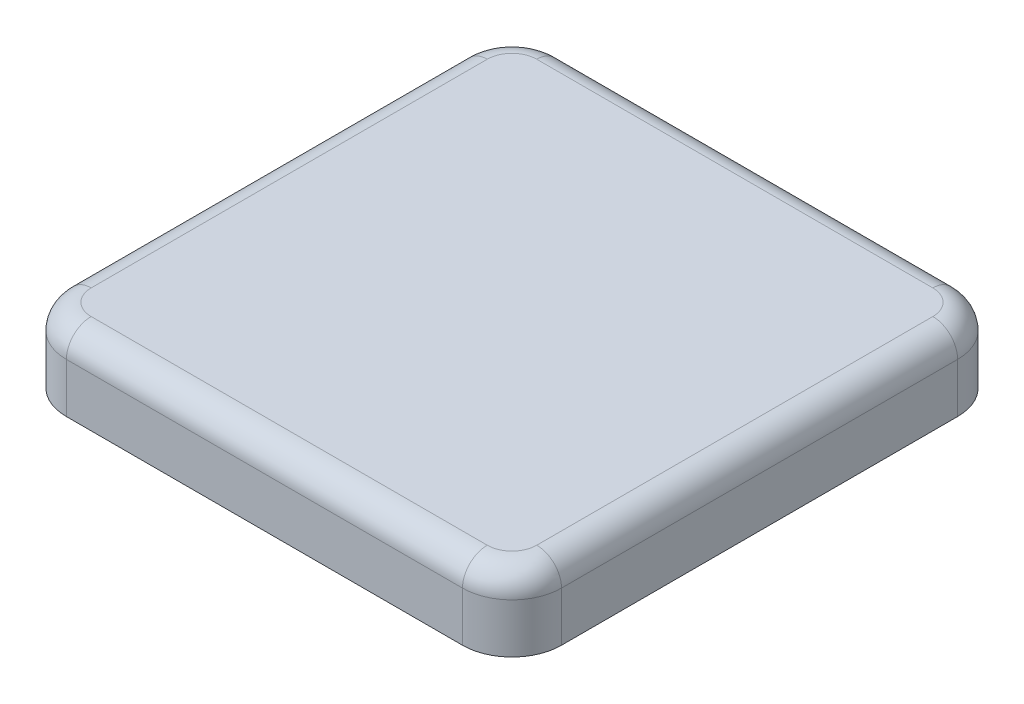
from build123d import *

# Parameters (mm, degrees)
EXTRUDE_1_DEPTH     = 1.5
FILLET_1_R          = 1
CUT_EXTRUDE_2_DEPTH = 1
SKETCH_3_W          = 1
SKETCH_3_H          = 5
EXTRUDE_3_DEPTH     = 2
SKETCH_4_W          = 2.4
SKETCH_4_H          = 4.2
EXTRUDE_4_DEPTH     = 7
FILLET_2_R          = 1


with BuildPart() as part:
    # Sketch 1 → Extrude 1 (new, symmetric)
    with BuildSketch(Plane(origin=(0, 0, 0), x_dir=(0, 0, -1), z_dir=(0, 1, 0))):
        with BuildLine():
            Line((-8, 10), (8, 10))
            ThreePointArc((8, 10), (9.414213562, 9.414213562), (10, 8))
            Line((10, 8), (10, -8))
            ThreePointArc((10, -8), (9.414213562, -9.414213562), (8, -10))
            Line((8, -10), (-8, -10))
            ThreePointArc((-8, -10), (-9.414213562, -9.414213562), (-10, -8))
            Line((-10, -8), (-10, 8))
            ThreePointArc((-10, 8), (-9.414213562, 9.414213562), (-8, 10))
        make_face()
    extrude(amount=EXTRUDE_1_DEPTH, both=True)

    # Fillet 1
    fillet_1_edges = [part.edges().sort_by_distance(p)[0] for p in [
        (-9.414213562, 1.5, 9.414213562),
        (0, 1.5, 10),
        (9.414213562, 1.5, 9.414213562),
        (10, 1.5, 0),
        (9.414213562, 1.5, -9.414213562),
        (0, 1.5, -10),
        (-9.414213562, 1.5, -9.414213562),
        (-10, 1.5, 0),
    ]]
    fillet(fillet_1_edges, radius=FILLET_1_R)

    # Sketch 2 → Cut-Extrude 2 (cut)
    with BuildSketch(Plane.XZ.offset(1.5)):
        with BuildLine():
            Line((-8, 8.8), (8, 8.8))
            ThreePointArc((8, 8.8), (8.565685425, 8.565685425), (8.8, 8))
            Line((8.8, 8), (8.8, -8))
            ThreePointArc((8.8, -8), (8.565685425, -8.565685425), (8, -8.8))
            Line((8, -8.8), (-8, -8.8))
            ThreePointArc((-8, -8.8), (-8.565685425, -8.565685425), (-8.8, -8))
            Line((-8.8, -8), (-8.8, 8))
            ThreePointArc((-8.8, 8), (-8.565685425, 8.565685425), (-8, 8.8))
        make_face()
    extrude(amount=-CUT_EXTRUDE_2_DEPTH, mode=Mode.SUBTRACT)

    # Sketch 3 → Extrude 3 (add)
    with BuildSketch(Plane.XZ.offset(0.5)):
        with Locations((-8.3, 0)):
            Rectangle(SKETCH_3_W, SKETCH_3_H)
    extrude(amount=EXTRUDE_3_DEPTH)

    # Sketch 4 → Extrude 4 (add)
    with BuildSketch(Plane.XZ.offset(0.5)):
        Rectangle(SKETCH_4_W, SKETCH_4_H)
    extrude(amount=EXTRUDE_4_DEPTH)

    # Fillet 2
    fillet_2_edges = [part.edges().sort_by_distance(p)[0] for p in [
        (-1.2, -7.5, 0),
        (0, -7.5, -2.1),
        (1.2, -7.5, 0),
        (0, -7.5, 2.1),
    ]]
    fillet(fillet_2_edges, radius=FILLET_2_R)


solid = part.part
